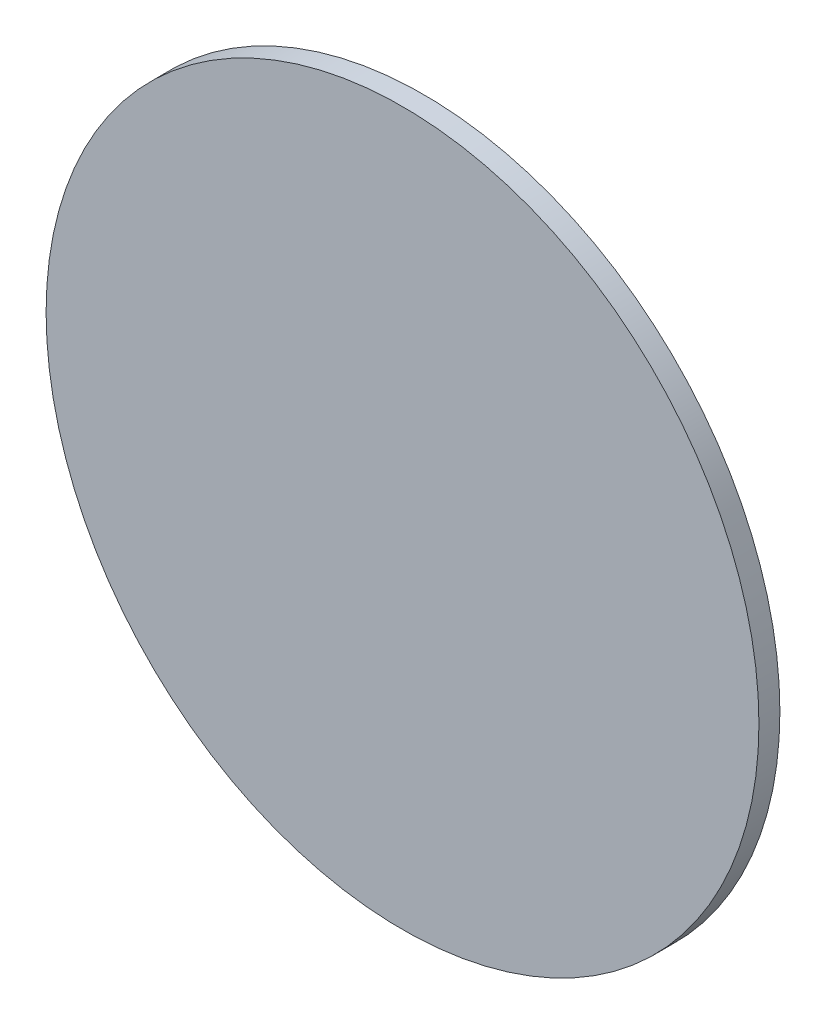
from build123d import *

# Parameters (mm, degrees)
SKETCH1_R          = 1.7
BASE_EXTRUDE_DEPTH = 0.1


with BuildPart() as part:
    # Sketch1 → Base-Extrude (new body)
    with BuildSketch(Plane.XY):
        Circle(SKETCH1_R)
    extrude(amount=BASE_EXTRUDE_DEPTH)


solid = part.part
